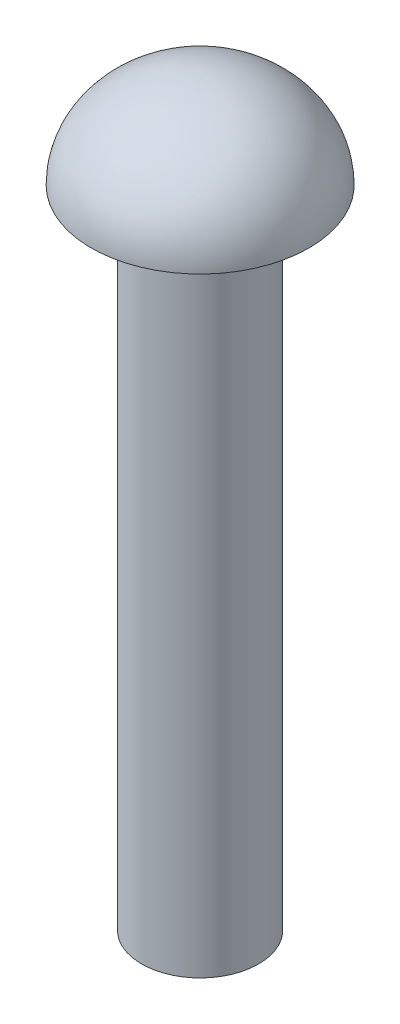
from build123d import *

# Parameters (mm, degrees)
ESQUISSE2_R        = 1.45
BOSS_EXTRU_1_DEPTH = 16


with BuildPart() as part:
    # Esquisse1 → R_volution2 (revolve)
    with BuildSketch(Plane.XY):
        with BuildLine():
            Line((0, 0), (2.7, 0))
            add(Edge.make_bspline(
                [(2.7, 0), (2.7, 2.3), (0, 2.3)],
                knots=[0, 0, 0, 1.570796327, 1.570796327, 1.570796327], degree=2, weights=[1, 0.707106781, 1]))
            Line((0, 2.3), (0, 0))
        make_face()
    revolve(axis=Axis((0, -11.043219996, 0), (0, 1, 0)))

    # Esquisse2 → Boss.-Extru.1 (add)
    with BuildSketch(Plane.XZ):
        with Locations(Location((0, 0, 0), (0, 0, 270))):
            Circle(ESQUISSE2_R)
    extrude(amount=BOSS_EXTRU_1_DEPTH)


solid = part.part
